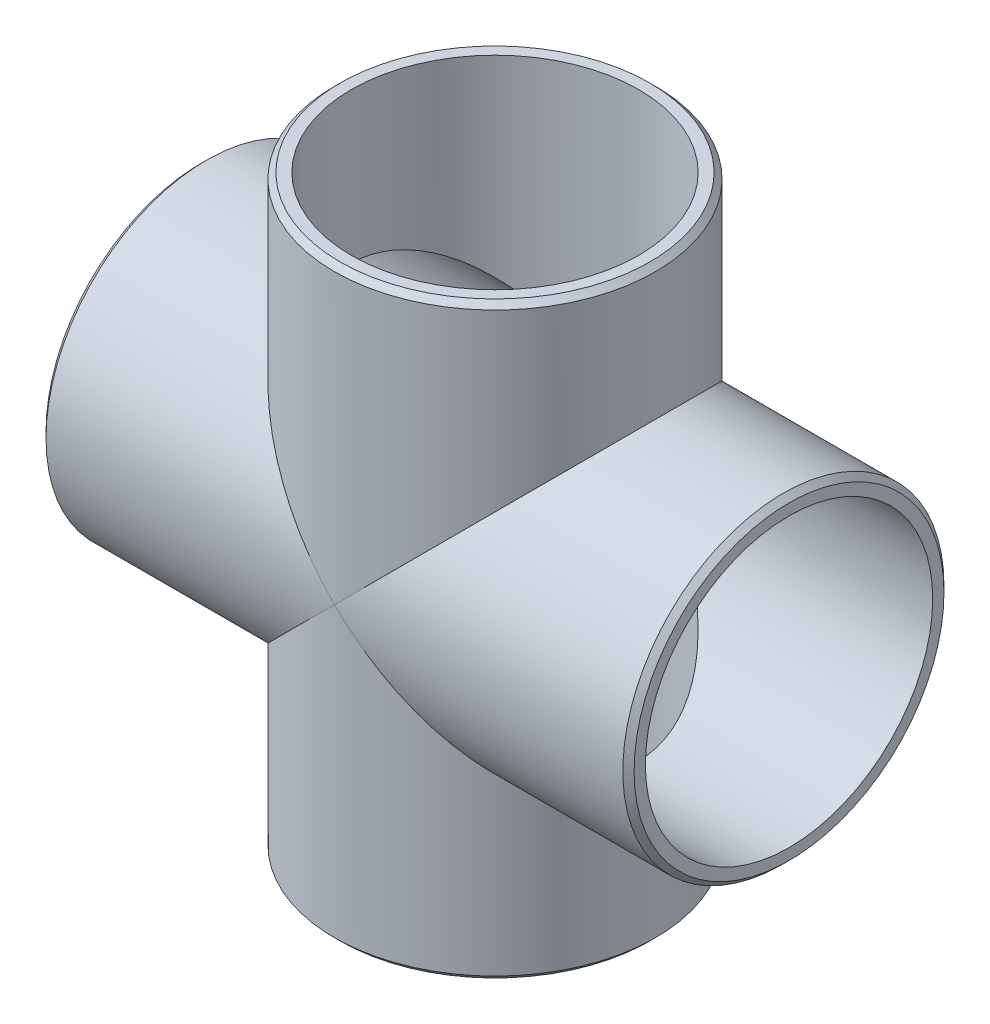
ISO-10303-21;
HEADER;
FILE_DESCRIPTION(('STEP AP214'),'2;1');
FILE_NAME('part.step','',(''),(''),'','','');
FILE_SCHEMA(('AUTOMOTIVE_DESIGN { 1 0 10303 214 1 1 1 1 }'));
ENDSEC;
DATA;
#1=APPLICATION_CONTEXT('core data for automotive mechanical design processes');
#2=APPLICATION_PROTOCOL_DEFINITION('international standard','automotive_design',2000,#1);
#3=PRODUCT_CONTEXT('',#1,'mechanical');
#4=PRODUCT('Part','Part','',(#3));
#5=PRODUCT_RELATED_PRODUCT_CATEGORY('part','',(#4));
#6=PRODUCT_DEFINITION_FORMATION('','',#4);
#7=PRODUCT_DEFINITION_CONTEXT('part definition',#1,'design');
#8=PRODUCT_DEFINITION('design','',#6,#7);
#9=PRODUCT_DEFINITION_SHAPE('','',#8);
#10=(LENGTH_UNIT() NAMED_UNIT(*) SI_UNIT(.MILLI.,.METRE.));
#11=(NAMED_UNIT(*) PLANE_ANGLE_UNIT() SI_UNIT($,.RADIAN.));
#12=(NAMED_UNIT(*) SI_UNIT($,.STERADIAN.) SOLID_ANGLE_UNIT());
#13=UNCERTAINTY_MEASURE_WITH_UNIT(LENGTH_MEASURE(1.E-05),#10,'distance_accuracy_value','');
#14=(GEOMETRIC_REPRESENTATION_CONTEXT(3) GLOBAL_UNCERTAINTY_ASSIGNED_CONTEXT((#13)) GLOBAL_UNIT_ASSIGNED_CONTEXT((#10,
#11,#12)) REPRESENTATION_CONTEXT('',''));
#15=CARTESIAN_POINT('',(0.,0.,0.));
#16=DIRECTION('',(0.,0.,1.));
#17=DIRECTION('',(1.,0.,0.));
#18=AXIS2_PLACEMENT_3D('',#15,#16,#17);
#19=CARTESIAN_POINT('',(-104.648,0.,0.));
#20=DIRECTION('',(-1.,0.,0.));
#21=DIRECTION('',(0.,0.,-1.));
#22=AXIS2_PLACEMENT_3D('',#19,#20,#21);
#23=PLANE('',#22);
#24=CARTESIAN_POINT('',(-104.648,0.,0.));
#25=DIRECTION('',(-1.,0.,0.));
#26=DIRECTION('',(0.,0.,1.));
#27=AXIS2_PLACEMENT_3D('',#24,#25,#26);
#28=CIRCLE('',#27,55.1434);
#29=CARTESIAN_POINT('',(-104.648,0.,55.1434));
#30=VERTEX_POINT('',#29);
#31=EDGE_CURVE('E105',#30,#30,#28,.T.);
#32=ORIENTED_EDGE('',*,*,#31,.T.);
#33=EDGE_LOOP('',(#32));
#34=FACE_BOUND('',#33,.T.);
#35=CARTESIAN_POINT('',(-104.648,0.,0.));
#36=DIRECTION('',(-1.,0.,0.));
#37=DIRECTION('',(0.,0.,1.));
#38=AXIS2_PLACEMENT_3D('',#35,#36,#37);
#39=CIRCLE('',#38,51.1302);
#40=CARTESIAN_POINT('',(-104.648,0.,51.1302));
#41=VERTEX_POINT('',#40);
#42=EDGE_CURVE('E88',#41,#41,#39,.F.);
#43=ORIENTED_EDGE('',*,*,#42,.T.);
#44=EDGE_LOOP('',(#43));
#45=FACE_BOUND('',#44,.T.);
#46=ADVANCED_FACE('F34',(#34,#45),#23,.T.);
#47=CARTESIAN_POINT('',(0.,-104.648,0.));
#48=DIRECTION('',(0.,-1.,0.));
#49=DIRECTION('',(0.,0.,1.));
#50=AXIS2_PLACEMENT_3D('',#47,#48,#49);
#51=PLANE('',#50);
#52=CARTESIAN_POINT('',(0.,-104.648,0.));
#53=DIRECTION('',(0.,-1.,0.));
#54=DIRECTION('',(0.,0.,-1.));
#55=AXIS2_PLACEMENT_3D('',#52,#53,#54);
#56=CIRCLE('',#55,55.1434);
#57=CARTESIAN_POINT('',(0.,-104.648,-55.1434));
#58=VERTEX_POINT('',#57);
#59=EDGE_CURVE('E111',#58,#58,#56,.T.);
#60=ORIENTED_EDGE('',*,*,#59,.T.);
#61=EDGE_LOOP('',(#60));
#62=FACE_BOUND('',#61,.T.);
#63=CARTESIAN_POINT('',(0.,-104.648,0.));
#64=DIRECTION('',(0.,-1.,0.));
#65=DIRECTION('',(0.,0.,-1.));
#66=AXIS2_PLACEMENT_3D('',#63,#64,#65);
#67=CIRCLE('',#66,51.1302);
#68=CARTESIAN_POINT('',(0.,-104.648,-51.1302));
#69=VERTEX_POINT('',#68);
#70=EDGE_CURVE('E81',#69,#69,#67,.F.);
#71=ORIENTED_EDGE('',*,*,#70,.T.);
#72=EDGE_LOOP('',(#71));
#73=FACE_BOUND('',#72,.T.);
#74=ADVANCED_FACE('F135',(#62,#73),#51,.T.);
#75=CARTESIAN_POINT('',(104.648,0.,0.));
#76=DIRECTION('',(-1.,0.,0.));
#77=DIRECTION('',(0.,0.,1.));
#78=AXIS2_PLACEMENT_3D('',#75,#76,#77);
#79=CYLINDRICAL_SURFACE('',#78,57.15);
#80=CARTESIAN_POINT('',(-102.6414,0.,0.));
#81=DIRECTION('',(-1.,0.,0.));
#82=DIRECTION('',(0.,0.,1.));
#83=AXIS2_PLACEMENT_3D('',#80,#81,#82);
#84=CIRCLE('',#83,57.15);
#85=CARTESIAN_POINT('',(-102.6414,0.,57.15));
#86=VERTEX_POINT('',#85);
#87=EDGE_CURVE('E102',#86,#86,#84,.F.);
#88=ORIENTED_EDGE('',*,*,#87,.T.);
#89=EDGE_LOOP('',(#88));
#90=FACE_BOUND('',#89,.T.);
#91=CARTESIAN_POINT('',(0.,0.,0.));
#92=DIRECTION('',(0.707106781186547,-0.707106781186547,0.));
#93=DIRECTION('',(-0.707106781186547,-0.707106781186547,0.));
#94=AXIS2_PLACEMENT_3D('',#91,#92,#93);
#95=ELLIPSE('',#94,80.8223050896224,57.15);
#96=CARTESIAN_POINT('',(0.,0.,-57.15));
#97=VERTEX_POINT('',#96);
#98=CARTESIAN_POINT('',(0.,0.,57.15));
#99=VERTEX_POINT('',#98);
#100=EDGE_CURVE('E96',#97,#99,#95,.F.);
#101=ORIENTED_EDGE('',*,*,#100,.T.);
#102=CARTESIAN_POINT('',(0.,0.,0.));
#103=DIRECTION('',(-0.707106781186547,-0.707106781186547,0.));
#104=DIRECTION('',(-0.707106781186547,0.707106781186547,0.));
#105=AXIS2_PLACEMENT_3D('',#102,#103,#104);
#106=ELLIPSE('',#105,80.8223050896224,57.15);
#107=EDGE_CURVE('E54',#97,#99,#106,.F.);
#108=ORIENTED_EDGE('',*,*,#107,.F.);
#109=EDGE_LOOP('',(#101,#108));
#110=FACE_BOUND('',#109,.T.);
#111=ADVANCED_FACE('F141',(#90,#110),#79,.T.);
#112=CARTESIAN_POINT('',(102.6414,0.,0.));
#113=DIRECTION('',(1.,0.,0.));
#114=DIRECTION('',(0.,0.,-1.));
#115=AXIS2_PLACEMENT_3D('',#112,#113,#114);
#116=CIRCLE('',#115,57.15);
#117=CARTESIAN_POINT('',(102.6414,0.,-57.15));
#118=VERTEX_POINT('',#117);
#119=EDGE_CURVE('E117',#118,#118,#116,.F.);
#120=ORIENTED_EDGE('',*,*,#119,.T.);
#121=EDGE_LOOP('',(#120));
#122=FACE_BOUND('',#121,.T.);
#123=CARTESIAN_POINT('',(0.,0.,0.));
#124=DIRECTION('',(0.707106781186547,0.707106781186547,0.));
#125=DIRECTION('',(-0.707106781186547,0.707106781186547,0.));
#126=AXIS2_PLACEMENT_3D('',#123,#124,#125);
#127=ELLIPSE('',#126,80.8223050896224,57.15);
#128=EDGE_CURVE('E48',#99,#97,#127,.T.);
#129=ORIENTED_EDGE('',*,*,#128,.T.);
#130=CARTESIAN_POINT('',(0.,0.,0.));
#131=DIRECTION('',(-0.707106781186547,0.707106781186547,0.));
#132=DIRECTION('',(-0.707106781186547,-0.707106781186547,0.));
#133=AXIS2_PLACEMENT_3D('',#130,#131,#132);
#134=ELLIPSE('',#133,80.8223050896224,57.15);
#135=EDGE_CURVE('E99',#99,#97,#134,.T.);
#136=ORIENTED_EDGE('',*,*,#135,.F.);
#137=EDGE_LOOP('',(#129,#136));
#138=FACE_BOUND('',#137,.T.);
#139=ADVANCED_FACE('F152',(#122,#138),#79,.T.);
#140=CARTESIAN_POINT('',(104.648,0.,0.));
#141=DIRECTION('',(1.,0.,0.));
#142=DIRECTION('',(0.,0.,-1.));
#143=AXIS2_PLACEMENT_3D('',#140,#141,#142);
#144=PLANE('',#143);
#145=CARTESIAN_POINT('',(104.648,0.,0.));
#146=DIRECTION('',(1.,0.,0.));
#147=DIRECTION('',(0.,0.,-1.));
#148=AXIS2_PLACEMENT_3D('',#145,#146,#147);
#149=CIRCLE('',#148,55.1434);
#150=CARTESIAN_POINT('',(104.648,0.,-55.1434));
#151=VERTEX_POINT('',#150);
#152=EDGE_CURVE('E114',#151,#151,#149,.T.);
#153=ORIENTED_EDGE('',*,*,#152,.T.);
#154=EDGE_LOOP('',(#153));
#155=FACE_BOUND('',#154,.T.);
#156=CARTESIAN_POINT('',(104.648,0.,0.));
#157=DIRECTION('',(1.,0.,0.));
#158=DIRECTION('',(0.,0.,-1.));
#159=AXIS2_PLACEMENT_3D('',#156,#157,#158);
#160=CIRCLE('',#159,51.1302);
#161=CARTESIAN_POINT('',(104.648,0.,-51.1302));
#162=VERTEX_POINT('',#161);
#163=EDGE_CURVE('E75',#162,#162,#160,.T.);
#164=ORIENTED_EDGE('',*,*,#163,.F.);
#165=EDGE_LOOP('',(#164));
#166=FACE_BOUND('',#165,.T.);
#167=ADVANCED_FACE('F149',(#155,#166),#144,.T.);
#168=CARTESIAN_POINT('',(0.,104.648,0.));
#169=DIRECTION('',(0.,-1.,0.));
#170=DIRECTION('',(0.,0.,-1.));
#171=AXIS2_PLACEMENT_3D('',#168,#169,#170);
#172=CYLINDRICAL_SURFACE('',#171,57.15);
#173=CARTESIAN_POINT('',(0.,102.6414,0.));
#174=DIRECTION('',(0.,1.,0.));
#175=DIRECTION('',(0.,0.,1.));
#176=AXIS2_PLACEMENT_3D('',#173,#174,#175);
#177=CIRCLE('',#176,57.15);
#178=CARTESIAN_POINT('',(0.,102.6414,57.15));
#179=VERTEX_POINT('',#178);
#180=EDGE_CURVE('E11',#179,#179,#177,.F.);
#181=ORIENTED_EDGE('',*,*,#180,.T.);
#182=EDGE_LOOP('',(#181));
#183=FACE_BOUND('',#182,.T.);
#184=ORIENTED_EDGE('',*,*,#135,.T.);
#185=ORIENTED_EDGE('',*,*,#107,.T.);
#186=EDGE_LOOP('',(#184,#185));
#187=FACE_BOUND('',#186,.T.);
#188=ADVANCED_FACE('F147',(#183,#187),#172,.T.);
#189=CARTESIAN_POINT('',(0.,104.648,0.));
#190=DIRECTION('',(0.,1.,0.));
#191=DIRECTION('',(0.,0.,1.));
#192=AXIS2_PLACEMENT_3D('',#189,#190,#191);
#193=PLANE('',#192);
#194=CARTESIAN_POINT('',(0.,104.648,0.));
#195=DIRECTION('',(0.,1.,0.));
#196=DIRECTION('',(0.,0.,1.));
#197=AXIS2_PLACEMENT_3D('',#194,#195,#196);
#198=CIRCLE('',#197,55.1434);
#199=CARTESIAN_POINT('',(0.,104.648,55.1434));
#200=VERTEX_POINT('',#199);
#201=EDGE_CURVE('E42',#200,#200,#198,.T.);
#202=ORIENTED_EDGE('',*,*,#201,.T.);
#203=EDGE_LOOP('',(#202));
#204=FACE_BOUND('',#203,.T.);
#205=CARTESIAN_POINT('',(0.,104.648,0.));
#206=DIRECTION('',(0.,1.,0.));
#207=DIRECTION('',(0.,0.,1.));
#208=AXIS2_PLACEMENT_3D('',#205,#206,#207);
#209=CIRCLE('',#208,51.1302);
#210=CARTESIAN_POINT('',(0.,104.648,51.1302));
#211=VERTEX_POINT('',#210);
#212=EDGE_CURVE('E80',#211,#211,#209,.T.);
#213=ORIENTED_EDGE('',*,*,#212,.F.);
#214=EDGE_LOOP('',(#213));
#215=FACE_BOUND('',#214,.T.);
#216=ADVANCED_FACE('F122',(#204,#215),#193,.T.);
#217=CARTESIAN_POINT('',(0.,-104.648,0.));
#218=DIRECTION('',(0.,1.,0.));
#219=DIRECTION('',(0.,0.,-1.));
#220=AXIS2_PLACEMENT_3D('',#217,#218,#219);
#221=CYLINDRICAL_SURFACE('',#220,57.15);
#222=CARTESIAN_POINT('',(0.,-102.6414,0.));
#223=DIRECTION('',(0.,-1.,0.));
#224=DIRECTION('',(0.,0.,-1.));
#225=AXIS2_PLACEMENT_3D('',#222,#223,#224);
#226=CIRCLE('',#225,57.15);
#227=CARTESIAN_POINT('',(0.,-102.6414,-57.15));
#228=VERTEX_POINT('',#227);
#229=EDGE_CURVE('E108',#228,#228,#226,.F.);
#230=ORIENTED_EDGE('',*,*,#229,.T.);
#231=EDGE_LOOP('',(#230));
#232=FACE_BOUND('',#231,.T.);
#233=ORIENTED_EDGE('',*,*,#128,.F.);
#234=ORIENTED_EDGE('',*,*,#100,.F.);
#235=EDGE_LOOP('',(#233,#234));
#236=FACE_BOUND('',#235,.T.);
#237=ADVANCED_FACE('F169',(#232,#236),#221,.T.);
#238=CARTESIAN_POINT('',(104.648,0.,0.));
#239=DIRECTION('',(-1.,0.,0.));
#240=DIRECTION('',(0.,0.,1.));
#241=AXIS2_PLACEMENT_3D('',#238,#239,#240);
#242=CYLINDRICAL_SURFACE('',#241,51.1302);
#243=ORIENTED_EDGE('',*,*,#42,.F.);
#244=EDGE_LOOP('',(#243));
#245=FACE_BOUND('',#244,.T.);
#246=CARTESIAN_POINT('',(0.,0.,0.));
#247=DIRECTION('',(-0.707106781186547,0.707106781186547,0.));
#248=DIRECTION('',(0.707106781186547,0.707106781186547,0.));
#249=AXIS2_PLACEMENT_3D('',#246,#247,#248);
#250=ELLIPSE('',#249,72.3090222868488,51.1302);
#251=CARTESIAN_POINT('',(0.,0.,-51.1302));
#252=VERTEX_POINT('',#251);
#253=CARTESIAN_POINT('',(0.,0.,51.1302));
#254=VERTEX_POINT('',#253);
#255=EDGE_CURVE('E67',#252,#254,#250,.T.);
#256=ORIENTED_EDGE('',*,*,#255,.F.);
#257=CARTESIAN_POINT('',(0.,0.,0.));
#258=DIRECTION('',(-0.707106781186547,-0.707106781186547,0.));
#259=DIRECTION('',(-0.707106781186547,0.707106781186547,0.));
#260=AXIS2_PLACEMENT_3D('',#257,#258,#259);
#261=ELLIPSE('',#260,72.3090222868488,51.1302);
#262=EDGE_CURVE('E63',#252,#254,#261,.F.);
#263=ORIENTED_EDGE('',*,*,#262,.T.);
#264=EDGE_LOOP('',(#256,#263));
#265=FACE_BOUND('',#264,.T.);
#266=ADVANCED_FACE('F65',(#245,#265),#242,.F.);
#267=ORIENTED_EDGE('',*,*,#163,.T.);
#268=EDGE_LOOP('',(#267));
#269=FACE_BOUND('',#268,.T.);
#270=CARTESIAN_POINT('',(0.,0.,0.));
#271=DIRECTION('',(0.707106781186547,0.707106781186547,0.));
#272=DIRECTION('',(-0.707106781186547,0.707106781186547,0.));
#273=AXIS2_PLACEMENT_3D('',#270,#271,#272);
#274=ELLIPSE('',#273,72.3090222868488,51.1302);
#275=EDGE_CURVE('E79',#254,#252,#274,.T.);
#276=ORIENTED_EDGE('',*,*,#275,.F.);
#277=CARTESIAN_POINT('',(0.,0.,0.));
#278=DIRECTION('',(-0.707106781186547,0.707106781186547,0.));
#279=DIRECTION('',(-0.707106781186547,-0.707106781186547,0.));
#280=AXIS2_PLACEMENT_3D('',#277,#278,#279);
#281=ELLIPSE('',#280,72.3090222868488,51.1302);
#282=EDGE_CURVE('E70',#254,#252,#281,.T.);
#283=ORIENTED_EDGE('',*,*,#282,.T.);
#284=EDGE_LOOP('',(#276,#283));
#285=FACE_BOUND('',#284,.T.);
#286=ADVANCED_FACE('F83',(#269,#285),#242,.F.);
#287=CARTESIAN_POINT('',(0.,104.648,0.));
#288=DIRECTION('',(0.,-1.,0.));
#289=DIRECTION('',(0.,0.,-1.));
#290=AXIS2_PLACEMENT_3D('',#287,#288,#289);
#291=CYLINDRICAL_SURFACE('',#290,51.1302);
#292=ORIENTED_EDGE('',*,*,#212,.T.);
#293=EDGE_LOOP('',(#292));
#294=FACE_BOUND('',#293,.T.);
#295=ORIENTED_EDGE('',*,*,#282,.F.);
#296=ORIENTED_EDGE('',*,*,#262,.F.);
#297=EDGE_LOOP('',(#295,#296));
#298=FACE_BOUND('',#297,.T.);
#299=ADVANCED_FACE('F72',(#294,#298),#291,.F.);
#300=CARTESIAN_POINT('',(0.,-104.648,0.));
#301=DIRECTION('',(0.,1.,0.));
#302=DIRECTION('',(0.,0.,-1.));
#303=AXIS2_PLACEMENT_3D('',#300,#301,#302);
#304=CYLINDRICAL_SURFACE('',#303,51.1302);
#305=ORIENTED_EDGE('',*,*,#70,.F.);
#306=EDGE_LOOP('',(#305));
#307=FACE_BOUND('',#306,.T.);
#308=ORIENTED_EDGE('',*,*,#275,.T.);
#309=ORIENTED_EDGE('',*,*,#255,.T.);
#310=EDGE_LOOP('',(#308,#309));
#311=FACE_BOUND('',#310,.T.);
#312=ADVANCED_FACE('F78',(#307,#311),#304,.F.);
#313=CARTESIAN_POINT('',(-102.6414,0.,0.));
#314=DIRECTION('',(1.,0.,0.));
#315=DIRECTION('',(0.,0.,-1.));
#316=AXIS2_PLACEMENT_3D('',#313,#314,#315);
#317=CONICAL_SURFACE('',#316,57.15,0.785398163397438);
#318=ORIENTED_EDGE('',*,*,#31,.F.);
#319=EDGE_LOOP('',(#318));
#320=FACE_BOUND('',#319,.T.);
#321=ORIENTED_EDGE('',*,*,#87,.F.);
#322=EDGE_LOOP('',(#321));
#323=FACE_BOUND('',#322,.T.);
#324=ADVANCED_FACE('F157',(#320,#323),#317,.T.);
#325=CARTESIAN_POINT('',(0.,-102.6414,0.));
#326=DIRECTION('',(0.,1.,0.));
#327=DIRECTION('',(0.,0.,1.));
#328=AXIS2_PLACEMENT_3D('',#325,#326,#327);
#329=CONICAL_SURFACE('',#328,57.15,0.785398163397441);
#330=ORIENTED_EDGE('',*,*,#59,.F.);
#331=EDGE_LOOP('',(#330));
#332=FACE_BOUND('',#331,.T.);
#333=ORIENTED_EDGE('',*,*,#229,.F.);
#334=EDGE_LOOP('',(#333));
#335=FACE_BOUND('',#334,.T.);
#336=ADVANCED_FACE('F131',(#332,#335),#329,.T.);
#337=CARTESIAN_POINT('',(104.648,0.,0.));
#338=DIRECTION('',(-1.,0.,0.));
#339=DIRECTION('',(0.,0.,1.));
#340=AXIS2_PLACEMENT_3D('',#337,#338,#339);
#341=CONICAL_SURFACE('',#340,55.1434,0.785398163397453);
#342=ORIENTED_EDGE('',*,*,#119,.F.);
#343=EDGE_LOOP('',(#342));
#344=FACE_BOUND('',#343,.T.);
#345=ORIENTED_EDGE('',*,*,#152,.F.);
#346=EDGE_LOOP('',(#345));
#347=FACE_BOUND('',#346,.T.);
#348=ADVANCED_FACE('F126',(#344,#347),#341,.T.);
#349=CARTESIAN_POINT('',(0.,104.648,0.));
#350=DIRECTION('',(0.,-1.,0.));
#351=DIRECTION('',(0.,0.,-1.));
#352=AXIS2_PLACEMENT_3D('',#349,#350,#351);
#353=CONICAL_SURFACE('',#352,55.1434,0.785398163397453);
#354=ORIENTED_EDGE('',*,*,#180,.F.);
#355=EDGE_LOOP('',(#354));
#356=FACE_BOUND('',#355,.T.);
#357=ORIENTED_EDGE('',*,*,#201,.F.);
#358=EDGE_LOOP('',(#357));
#359=FACE_BOUND('',#358,.T.);
#360=ADVANCED_FACE('F36',(#356,#359),#353,.T.);
#361=CLOSED_SHELL('',(#46,#74,#111,#139,#167,#188,#216,#237,#266,#286,#299,#312,#324,#336,#348,#360));
#362=MANIFOLD_SOLID_BREP('B2',#361);
#363=ADVANCED_BREP_SHAPE_REPRESENTATION('',(#18,#362),#14);
#364=SHAPE_DEFINITION_REPRESENTATION(#9,#363);
ENDSEC;
END-ISO-10303-21;
